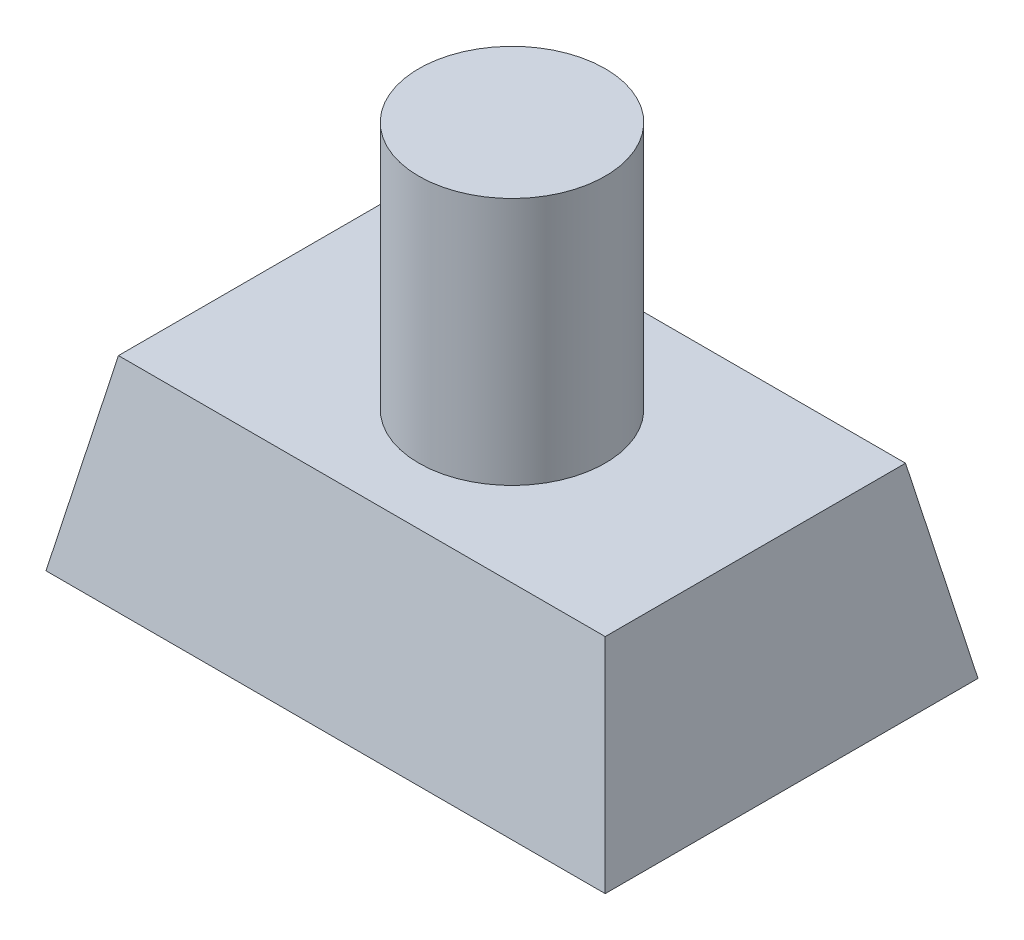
from build123d import *

# Parameters (mm, degrees)
SKETCH1_W      = 90
SKETCH1_H      = 60
EXTRUDE1_DEPTH = 30
EXTRUDE1_TAPER = 11
SKETCH2_R      = 15
EXTRUDE2_DEPTH = 40


with BuildPart() as part:
    # Sketch1 → Extrude1 (new body)
    with BuildSketch(Plane(origin=(0, 0, 0), x_dir=(1, 0, 0), z_dir=(0, 1, 0))):
        with Locations((45, 30)):
            Rectangle(SKETCH1_W, SKETCH1_H)
    extrude(amount=EXTRUDE1_DEPTH, taper=EXTRUDE1_TAPER)

    # Sketch2 → Extrude2 (add)
    with BuildSketch(Plane(origin=(0, 30, 0), x_dir=(-1, 0, 0), z_dir=(0, 1, 0))):
        with Locations(Location((-45, -30, 0), (0, 0, 270))):
            Circle(SKETCH2_R)
    extrude(amount=EXTRUDE2_DEPTH)


solid = part.part
